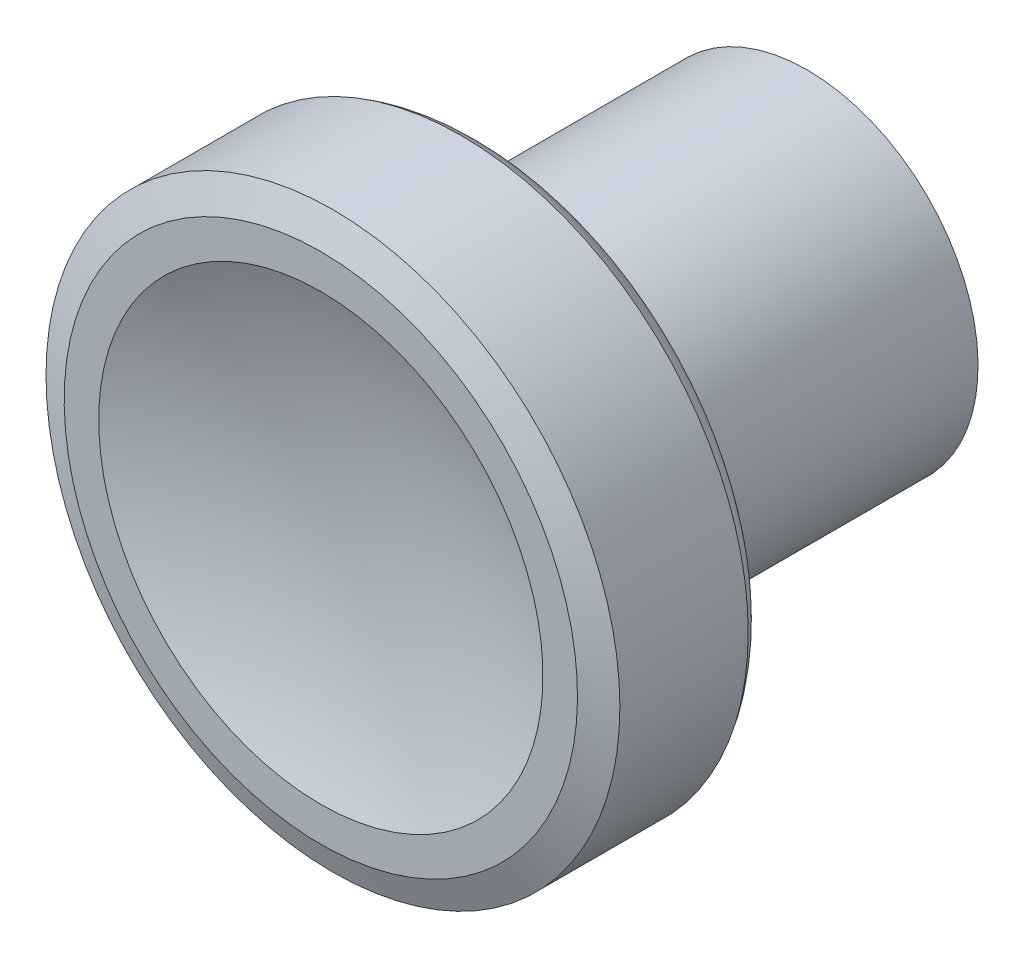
ISO-10303-21;
HEADER;
FILE_DESCRIPTION(('STEP AP214'),'2;1');
FILE_NAME('part.step','',(''),(''),'','','');
FILE_SCHEMA(('AUTOMOTIVE_DESIGN { 1 0 10303 214 1 1 1 1 }'));
ENDSEC;
DATA;
#1=APPLICATION_CONTEXT('core data for automotive mechanical design processes');
#2=APPLICATION_PROTOCOL_DEFINITION('international standard','automotive_design',2000,#1);
#3=PRODUCT_CONTEXT('',#1,'mechanical');
#4=PRODUCT('Part','Part','',(#3));
#5=PRODUCT_RELATED_PRODUCT_CATEGORY('part','',(#4));
#6=PRODUCT_DEFINITION_FORMATION('','',#4);
#7=PRODUCT_DEFINITION_CONTEXT('part definition',#1,'design');
#8=PRODUCT_DEFINITION('design','',#6,#7);
#9=PRODUCT_DEFINITION_SHAPE('','',#8);
#10=(LENGTH_UNIT() NAMED_UNIT(*) SI_UNIT(.MILLI.,.METRE.));
#11=(NAMED_UNIT(*) PLANE_ANGLE_UNIT() SI_UNIT($,.RADIAN.));
#12=(NAMED_UNIT(*) SI_UNIT($,.STERADIAN.) SOLID_ANGLE_UNIT());
#13=UNCERTAINTY_MEASURE_WITH_UNIT(LENGTH_MEASURE(1.E-05),#10,'distance_accuracy_value','');
#14=(GEOMETRIC_REPRESENTATION_CONTEXT(3) GLOBAL_UNCERTAINTY_ASSIGNED_CONTEXT((#13)) GLOBAL_UNIT_ASSIGNED_CONTEXT((#10,
#11,#12)) REPRESENTATION_CONTEXT('',''));
#15=CARTESIAN_POINT('',(0.,0.,0.));
#16=DIRECTION('',(0.,0.,1.));
#17=DIRECTION('',(1.,0.,0.));
#18=AXIS2_PLACEMENT_3D('',#15,#16,#17);
#19=CARTESIAN_POINT('',(3.5,0.,0.199999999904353));
#20=DIRECTION('',(0.,0.,-1.));
#21=DIRECTION('',(0.,1.,0.));
#22=AXIS2_PLACEMENT_3D('',#19,#20,#21);
#23=PLANE('',#22);
#24=CARTESIAN_POINT('',(0.,0.,0.2));
#25=DIRECTION('',(0.,0.,-1.));
#26=DIRECTION('',(0.,1.,0.));
#27=AXIS2_PLACEMENT_3D('',#24,#25,#26);
#28=CIRCLE('',#27,6.25);
#29=CARTESIAN_POINT('',(0.,6.25,0.2));
#30=VERTEX_POINT('',#29);
#31=EDGE_CURVE('E8',#30,#30,#28,.T.);
#32=ORIENTED_EDGE('',*,*,#31,.T.);
#33=EDGE_LOOP('',(#32));
#34=FACE_BOUND('',#33,.T.);
#35=CARTESIAN_POINT('',(0.,0.,0.199999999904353));
#36=DIRECTION('',(0.,0.,-1.));
#37=DIRECTION('',(0.,1.,0.));
#38=AXIS2_PLACEMENT_3D('',#35,#36,#37);
#39=CIRCLE('',#38,3.5);
#40=CARTESIAN_POINT('',(0.,3.5,0.199999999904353));
#41=VERTEX_POINT('',#40);
#42=EDGE_CURVE('E52',#41,#41,#39,.T.);
#43=ORIENTED_EDGE('',*,*,#42,.F.);
#44=EDGE_LOOP('',(#43));
#45=FACE_BOUND('',#44,.T.);
#46=ADVANCED_FACE('F12',(#34,#45),#23,.T.);
#47=CARTESIAN_POINT('',(0.,0.,-4.6630015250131));
#48=DIRECTION('',(0.,0.,-1.));
#49=DIRECTION('',(0.,1.,0.));
#50=AXIS2_PLACEMENT_3D('',#47,#48,#49);
#51=CYLINDRICAL_SURFACE('',#50,6.25);
#52=CARTESIAN_POINT('',(0.,0.,10.5));
#53=DIRECTION('',(0.,0.,-1.));
#54=DIRECTION('',(0.,1.,0.));
#55=AXIS2_PLACEMENT_3D('',#52,#53,#54);
#56=CIRCLE('',#55,6.25);
#57=CARTESIAN_POINT('',(0.,6.25,10.5));
#58=VERTEX_POINT('',#57);
#59=EDGE_CURVE('E18',#58,#58,#56,.T.);
#60=ORIENTED_EDGE('',*,*,#59,.T.);
#61=EDGE_LOOP('',(#60));
#62=FACE_BOUND('',#61,.T.);
#63=ORIENTED_EDGE('',*,*,#31,.F.);
#64=EDGE_LOOP('',(#63));
#65=FACE_BOUND('',#64,.T.);
#66=ADVANCED_FACE('F59',(#62,#65),#51,.T.);
#67=CARTESIAN_POINT('',(0.,0.,10.4930187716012));
#68=DIRECTION('',(0.,0.,-1.));
#69=DIRECTION('',(0.,1.,0.));
#70=AXIS2_PLACEMENT_3D('',#67,#68,#69);
#71=TOROIDAL_SURFACE('',#70,7.04996953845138,0.800000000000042);
#72=ORIENTED_EDGE('',*,*,#59,.F.);
#73=EDGE_LOOP('',(#72));
#74=FACE_BOUND('',#73,.T.);
#75=CARTESIAN_POINT('',(0.,0.,11.2657594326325));
#76=DIRECTION('',(0.,0.,-1.));
#77=DIRECTION('',(0.,1.,0.));
#78=AXIS2_PLACEMENT_3D('',#75,#76,#77);
#79=CIRCLE('',#78,6.84291430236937);
#80=CARTESIAN_POINT('',(0.,6.84291430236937,11.2657594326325));
#81=VERTEX_POINT('',#80);
#82=EDGE_CURVE('E22',#81,#81,#79,.T.);
#83=ORIENTED_EDGE('',*,*,#82,.T.);
#84=EDGE_LOOP('',(#83));
#85=FACE_BOUND('',#84,.T.);
#86=ADVANCED_FACE('F65',(#74,#85),#71,.F.);
#87=CARTESIAN_POINT('',(0.,0.,11.8244404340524));
#88=DIRECTION('',(0.,0.,1.));
#89=DIRECTION('',(0.,-1.,0.));
#90=AXIS2_PLACEMENT_3D('',#87,#88,#89);
#91=CONICAL_SURFACE('',#90,8.92794018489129,1.30899693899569);
#92=ORIENTED_EDGE('',*,*,#82,.F.);
#93=EDGE_LOOP('',(#92));
#94=FACE_BOUND('',#93,.T.);
#95=CARTESIAN_POINT('',(0.,0.,11.8244404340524));
#96=DIRECTION('',(0.,0.,-1.));
#97=DIRECTION('',(0.,1.,0.));
#98=AXIS2_PLACEMENT_3D('',#95,#96,#97);
#99=CIRCLE('',#98,8.92794018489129);
#100=CARTESIAN_POINT('',(0.,8.92794018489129,11.8244404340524));
#101=VERTEX_POINT('',#100);
#102=EDGE_CURVE('E26',#101,#101,#99,.T.);
#103=ORIENTED_EDGE('',*,*,#102,.T.);
#104=EDGE_LOOP('',(#103));
#105=FACE_BOUND('',#104,.T.);
#106=ADVANCED_FACE('F70',(#94,#105),#91,.T.);
#107=CARTESIAN_POINT('',(0.,0.,13.8158755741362));
#108=DIRECTION('',(0.,0.,-1.));
#109=DIRECTION('',(0.,1.,0.));
#110=AXIS2_PLACEMENT_3D('',#107,#108,#109);
#111=TOROIDAL_SURFACE('',#110,8.74304539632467,2.);
#112=CARTESIAN_POINT('',(0.,0.,12.860307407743));
#113=DIRECTION('',(0.,0.,-1.));
#114=DIRECTION('',(0.,1.,0.));
#115=AXIS2_PLACEMENT_3D('',#112,#113,#114);
#116=CIRCLE('',#115,10.5);
#117=CARTESIAN_POINT('',(0.,10.5,12.860307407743));
#118=VERTEX_POINT('',#117);
#119=EDGE_CURVE('E31',#118,#118,#116,.T.);
#120=ORIENTED_EDGE('',*,*,#119,.T.);
#121=EDGE_LOOP('',(#120));
#122=FACE_BOUND('',#121,.T.);
#123=ORIENTED_EDGE('',*,*,#102,.F.);
#124=EDGE_LOOP('',(#123));
#125=FACE_BOUND('',#124,.T.);
#126=ADVANCED_FACE('F77',(#122,#125),#111,.T.);
#127=CARTESIAN_POINT('',(0.,0.,-4.6630015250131));
#128=DIRECTION('',(0.,0.,-1.));
#129=DIRECTION('',(0.,1.,0.));
#130=AXIS2_PLACEMENT_3D('',#127,#128,#129);
#131=CYLINDRICAL_SURFACE('',#130,10.5);
#132=ORIENTED_EDGE('',*,*,#119,.F.);
#133=EDGE_LOOP('',(#132));
#134=FACE_BOUND('',#133,.T.);
#135=CARTESIAN_POINT('',(0.,0.,17.5568228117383));
#136=DIRECTION('',(0.,0.,-1.));
#137=DIRECTION('',(0.,1.,0.));
#138=AXIS2_PLACEMENT_3D('',#135,#136,#137);
#139=CIRCLE('',#138,10.5);
#140=CARTESIAN_POINT('',(0.,10.5,17.5568228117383));
#141=VERTEX_POINT('',#140);
#142=EDGE_CURVE('E34',#141,#141,#139,.T.);
#143=ORIENTED_EDGE('',*,*,#142,.T.);
#144=EDGE_LOOP('',(#143));
#145=FACE_BOUND('',#144,.T.);
#146=ADVANCED_FACE('F81',(#134,#145),#131,.T.);
#147=CARTESIAN_POINT('',(0.,0.,17.9999999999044));
#148=DIRECTION('',(0.,0.,-1.));
#149=DIRECTION('',(0.,1.,0.));
#150=AXIS2_PLACEMENT_3D('',#147,#148,#149);
#151=CONICAL_SURFACE('',#150,9.39229141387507,1.19021698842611);
#152=ORIENTED_EDGE('',*,*,#142,.F.);
#153=EDGE_LOOP('',(#152));
#154=FACE_BOUND('',#153,.T.);
#155=CARTESIAN_POINT('',(0.,0.,17.9999999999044));
#156=DIRECTION('',(0.,0.,-1.));
#157=DIRECTION('',(0.,1.,0.));
#158=AXIS2_PLACEMENT_3D('',#155,#156,#157);
#159=CIRCLE('',#158,9.39229141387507);
#160=CARTESIAN_POINT('',(0.,9.39229141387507,17.9999999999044));
#161=VERTEX_POINT('',#160);
#162=EDGE_CURVE('E37',#161,#161,#159,.T.);
#163=ORIENTED_EDGE('',*,*,#162,.T.);
#164=EDGE_LOOP('',(#163));
#165=FACE_BOUND('',#164,.T.);
#166=ADVANCED_FACE('F85',(#154,#165),#151,.T.);
#167=CARTESIAN_POINT('',(9.39229141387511,0.,17.9999999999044));
#168=DIRECTION('',(0.,0.,1.));
#169=DIRECTION('',(0.,-1.,0.));
#170=AXIS2_PLACEMENT_3D('',#167,#168,#169);
#171=PLANE('',#170);
#172=CARTESIAN_POINT('',(0.,0.,17.9999999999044));
#173=DIRECTION('',(0.,0.,-1.));
#174=DIRECTION('',(0.,1.,0.));
#175=AXIS2_PLACEMENT_3D('',#172,#173,#174);
#176=CIRCLE('',#175,8.12772401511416);
#177=CARTESIAN_POINT('',(0.,8.12772401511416,17.9999999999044));
#178=VERTEX_POINT('',#177);
#179=EDGE_CURVE('E40',#178,#178,#176,.T.);
#180=ORIENTED_EDGE('',*,*,#179,.T.);
#181=EDGE_LOOP('',(#180));
#182=FACE_BOUND('',#181,.T.);
#183=ORIENTED_EDGE('',*,*,#162,.F.);
#184=EDGE_LOOP('',(#183));
#185=FACE_BOUND('',#184,.T.);
#186=ADVANCED_FACE('F89',(#182,#185),#171,.T.);
#187=CARTESIAN_POINT('',(0.,0.,37.5129983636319));
#188=DIRECTION('',(0.,-1.,0.));
#189=DIRECTION('',(1.,0.,0.));
#190=AXIS2_PLACEMENT_3D('',#187,#188,#189);
#191=SPHERICAL_SURFACE('',#190,21.1380463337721);
#192=CARTESIAN_POINT('',(0.,0.,37.5129983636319));
#193=DIRECTION('',(0.,0.,-1.));
#194=DIRECTION('',(0.,1.,0.));
#195=AXIS2_PLACEMENT_3D('',#192,#193,#194);
#196=SPHERICAL_SURFACE('',#195,21.1380463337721);
#197=ORIENTED_EDGE('',*,*,#179,.F.);
#198=EDGE_LOOP('',(#197));
#199=FACE_BOUND('',#198,.T.);
#200=ADVANCED_FACE('F93',(#199),#196,.F.);
#201=CARTESIAN_POINT('',(2.5,0.,10.));
#202=DIRECTION('',(0.,0.,1.));
#203=DIRECTION('',(0.,-1.,0.));
#204=AXIS2_PLACEMENT_3D('',#201,#202,#203);
#205=PLANE('',#204);
#206=CARTESIAN_POINT('',(0.,0.,10.));
#207=DIRECTION('',(0.,0.,-1.));
#208=DIRECTION('',(0.,1.,0.));
#209=AXIS2_PLACEMENT_3D('',#206,#207,#208);
#210=CIRCLE('',#209,2.5);
#211=CARTESIAN_POINT('',(0.,2.5,10.));
#212=VERTEX_POINT('',#211);
#213=EDGE_CURVE('E43',#212,#212,#210,.T.);
#214=ORIENTED_EDGE('',*,*,#213,.T.);
#215=EDGE_LOOP('',(#214));
#216=FACE_BOUND('',#215,.T.);
#217=ADVANCED_FACE('F97',(#216),#205,.F.);
#218=CARTESIAN_POINT('',(0.,0.,-4.6630015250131));
#219=DIRECTION('',(0.,0.,-1.));
#220=DIRECTION('',(0.,1.,0.));
#221=AXIS2_PLACEMENT_3D('',#218,#219,#220);
#222=CYLINDRICAL_SURFACE('',#221,2.5);
#223=ORIENTED_EDGE('',*,*,#213,.F.);
#224=EDGE_LOOP('',(#223));
#225=FACE_BOUND('',#224,.T.);
#226=CARTESIAN_POINT('',(0.,0.,0.));
#227=DIRECTION('',(0.,0.,-1.));
#228=DIRECTION('',(0.,1.,0.));
#229=AXIS2_PLACEMENT_3D('',#226,#227,#228);
#230=CIRCLE('',#229,2.5);
#231=CARTESIAN_POINT('',(0.,2.5,0.));
#232=VERTEX_POINT('',#231);
#233=EDGE_CURVE('E46',#232,#232,#230,.T.);
#234=ORIENTED_EDGE('',*,*,#233,.T.);
#235=EDGE_LOOP('',(#234));
#236=FACE_BOUND('',#235,.T.);
#237=ADVANCED_FACE('F101',(#225,#236),#222,.F.);
#238=CARTESIAN_POINT('',(2.5,0.,0.));
#239=DIRECTION('',(0.,0.,-1.));
#240=DIRECTION('',(0.,1.,0.));
#241=AXIS2_PLACEMENT_3D('',#238,#239,#240);
#242=PLANE('',#241);
#243=CARTESIAN_POINT('',(0.,0.,-9.56457135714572E-11));
#244=DIRECTION('',(0.,0.,-1.));
#245=DIRECTION('',(0.,1.,0.));
#246=AXIS2_PLACEMENT_3D('',#243,#244,#245);
#247=CIRCLE('',#246,3.5);
#248=CARTESIAN_POINT('',(0.,3.5,-9.56457135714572E-11));
#249=VERTEX_POINT('',#248);
#250=EDGE_CURVE('E49',#249,#249,#247,.T.);
#251=ORIENTED_EDGE('',*,*,#250,.T.);
#252=EDGE_LOOP('',(#251));
#253=FACE_BOUND('',#252,.T.);
#254=ORIENTED_EDGE('',*,*,#233,.F.);
#255=EDGE_LOOP('',(#254));
#256=FACE_BOUND('',#255,.T.);
#257=ADVANCED_FACE('F105',(#253,#256),#242,.T.);
#258=CARTESIAN_POINT('',(0.,0.,-4.6630015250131));
#259=DIRECTION('',(0.,0.,-1.));
#260=DIRECTION('',(0.,1.,0.));
#261=AXIS2_PLACEMENT_3D('',#258,#259,#260);
#262=CYLINDRICAL_SURFACE('',#261,3.5);
#263=ORIENTED_EDGE('',*,*,#250,.F.);
#264=EDGE_LOOP('',(#263));
#265=FACE_BOUND('',#264,.T.);
#266=ORIENTED_EDGE('',*,*,#42,.T.);
#267=EDGE_LOOP('',(#266));
#268=FACE_BOUND('',#267,.T.);
#269=ADVANCED_FACE('F56',(#265,#268),#262,.T.);
#270=CLOSED_SHELL('',(#46,#66,#86,#106,#126,#146,#166,#186,#200,#217,#237,#257,#269));
#271=MANIFOLD_SOLID_BREP('B1',#270);
#272=ADVANCED_BREP_SHAPE_REPRESENTATION('',(#18,#271),#14);
#273=SHAPE_DEFINITION_REPRESENTATION(#9,#272);
ENDSEC;
END-ISO-10303-21;
